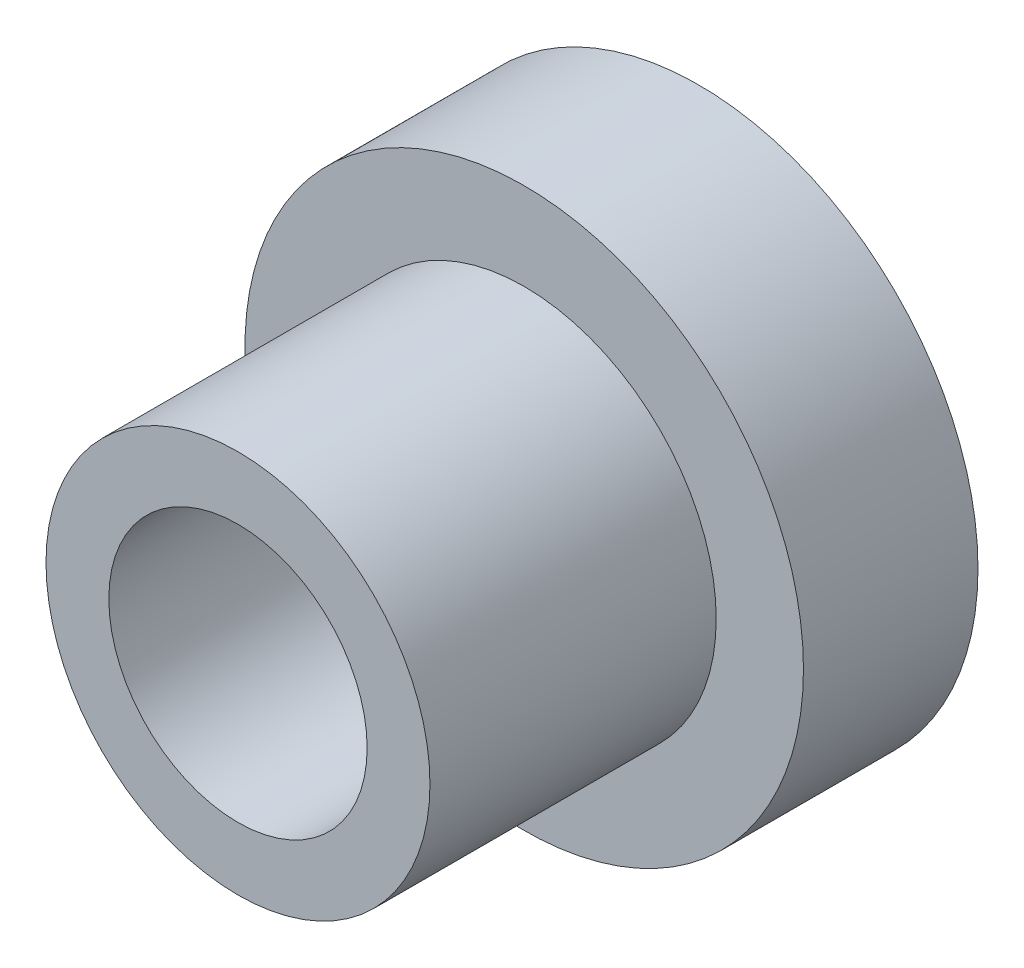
from build123d import *

# Parameters (mm, degrees)
SKETCH1_R           = 10.16
BOSS_EXTRUDE1_DEPTH = 6.35
SKETCH2_R           = 6.985
BOSS_EXTRUDE2_DEPTH = 10.414
SKETCH3_R           = 4.699
CUT_EXTRUDE1_DEPTH  = 23.079014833


with BuildPart() as part:
    # Sketch1 → Boss-Extrude1 (new body)
    with BuildSketch(Plane.XY):
        Circle(SKETCH1_R)
    extrude(amount=BOSS_EXTRUDE1_DEPTH)

    # Sketch2 → Boss-Extrude2 (add)
    with BuildSketch(Plane.XY.offset(6.35)):
        Circle(SKETCH2_R)
    extrude(amount=BOSS_EXTRUDE2_DEPTH)

    # Sketch3 → Cut-Extrude1 (cut, through all)
    with BuildSketch(Plane.XY.offset(16.764)):
        Circle(SKETCH3_R)
    extrude(amount=-CUT_EXTRUDE1_DEPTH, mode=Mode.SUBTRACT)


solid = part.part
